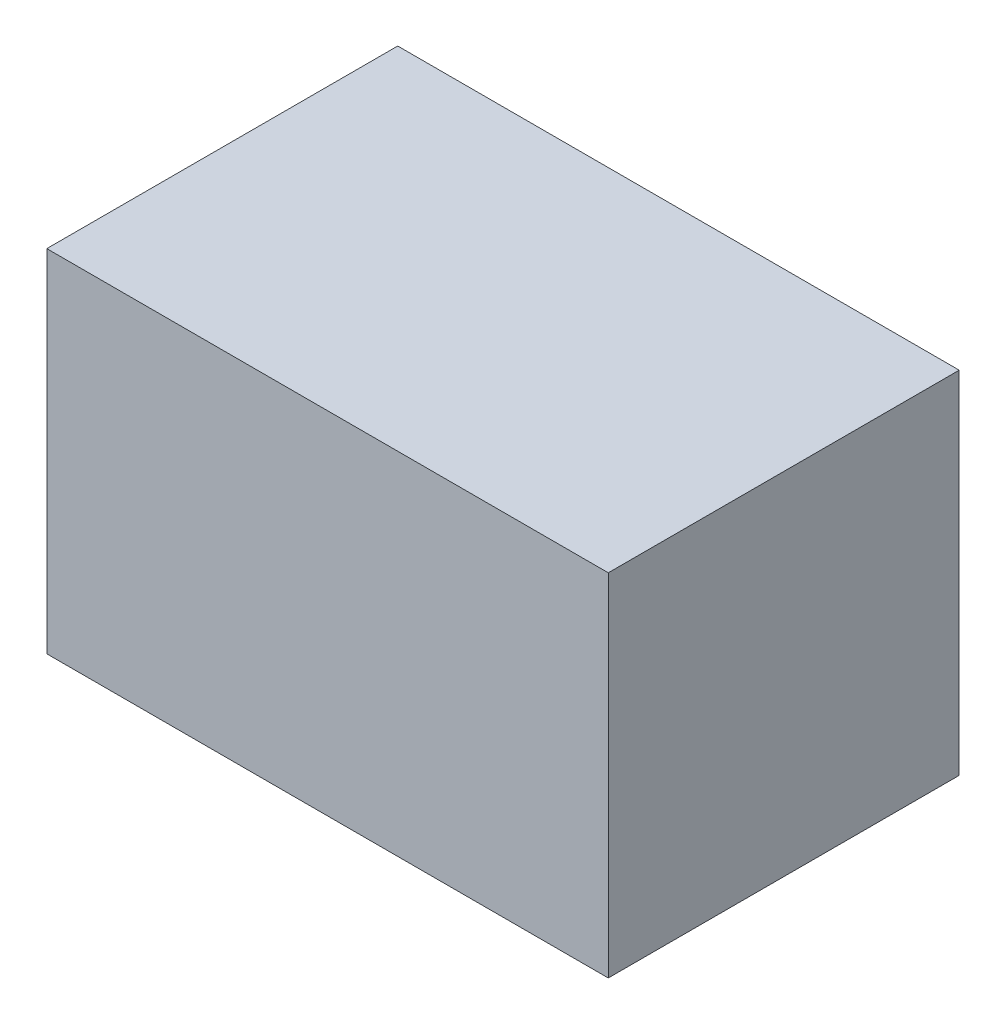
ISO-10303-21;
HEADER;
FILE_DESCRIPTION(('STEP AP214'),'2;1');
FILE_NAME('part.step','',(''),(''),'','','');
FILE_SCHEMA(('AUTOMOTIVE_DESIGN { 1 0 10303 214 1 1 1 1 }'));
ENDSEC;
DATA;
#1=APPLICATION_CONTEXT('core data for automotive mechanical design processes');
#2=APPLICATION_PROTOCOL_DEFINITION('international standard','automotive_design',2000,#1);
#3=PRODUCT_CONTEXT('',#1,'mechanical');
#4=PRODUCT('Part','Part','',(#3));
#5=PRODUCT_RELATED_PRODUCT_CATEGORY('part','',(#4));
#6=PRODUCT_DEFINITION_FORMATION('','',#4);
#7=PRODUCT_DEFINITION_CONTEXT('part definition',#1,'design');
#8=PRODUCT_DEFINITION('design','',#6,#7);
#9=PRODUCT_DEFINITION_SHAPE('','',#8);
#10=(LENGTH_UNIT() NAMED_UNIT(*) SI_UNIT(.MILLI.,.METRE.));
#11=(NAMED_UNIT(*) PLANE_ANGLE_UNIT() SI_UNIT($,.RADIAN.));
#12=(NAMED_UNIT(*) SI_UNIT($,.STERADIAN.) SOLID_ANGLE_UNIT());
#13=UNCERTAINTY_MEASURE_WITH_UNIT(LENGTH_MEASURE(1.E-05),#10,'distance_accuracy_value','');
#14=(GEOMETRIC_REPRESENTATION_CONTEXT(3) GLOBAL_UNCERTAINTY_ASSIGNED_CONTEXT((#13)) GLOBAL_UNIT_ASSIGNED_CONTEXT((#10,
#11,#12)) REPRESENTATION_CONTEXT('',''));
#15=CARTESIAN_POINT('',(0.,0.,0.));
#16=DIRECTION('',(0.,0.,1.));
#17=DIRECTION('',(1.,0.,0.));
#18=AXIS2_PLACEMENT_3D('',#15,#16,#17);
#19=CARTESIAN_POINT('',(40.,50.,25.));
#20=DIRECTION('',(-1.,0.,0.));
#21=DIRECTION('',(0.,0.,1.));
#22=AXIS2_PLACEMENT_3D('',#19,#20,#21);
#23=PLANE('',#22);
#24=DIRECTION('',(0.,0.,-1.));
#25=VECTOR('',#24,1.);
#26=CARTESIAN_POINT('',(40.,0.,25.));
#27=LINE('',#26,#25);
#28=CARTESIAN_POINT('',(40.,0.,25.));
#29=VERTEX_POINT('',#28);
#30=CARTESIAN_POINT('',(40.,0.,-25.));
#31=VERTEX_POINT('',#30);
#32=EDGE_CURVE('E209',#29,#31,#27,.T.);
#33=ORIENTED_EDGE('',*,*,#32,.T.);
#34=DIRECTION('',(0.,-1.,0.));
#35=VECTOR('',#34,1.);
#36=CARTESIAN_POINT('',(40.,50.,-25.));
#37=LINE('',#36,#35);
#38=CARTESIAN_POINT('',(40.,50.,-25.));
#39=VERTEX_POINT('',#38);
#40=EDGE_CURVE('E236',#39,#31,#37,.T.);
#41=ORIENTED_EDGE('',*,*,#40,.F.);
#42=DIRECTION('',(0.,0.,-1.));
#43=VECTOR('',#42,1.);
#44=CARTESIAN_POINT('',(40.,50.,25.));
#45=LINE('',#44,#43);
#46=CARTESIAN_POINT('',(40.,50.,25.));
#47=VERTEX_POINT('',#46);
#48=EDGE_CURVE('E210',#47,#39,#45,.T.);
#49=ORIENTED_EDGE('',*,*,#48,.F.);
#50=DIRECTION('',(0.,-1.,0.));
#51=VECTOR('',#50,1.);
#52=CARTESIAN_POINT('',(40.,50.,25.));
#53=LINE('',#52,#51);
#54=EDGE_CURVE('E220',#47,#29,#53,.T.);
#55=ORIENTED_EDGE('',*,*,#54,.T.);
#56=EDGE_LOOP('',(#33,#41,#49,#55));
#57=FACE_BOUND('',#56,.T.);
#58=ADVANCED_FACE('F35',(#57),#23,.F.);
#59=CARTESIAN_POINT('',(-40.,50.,-25.));
#60=DIRECTION('',(0.,0.,1.));
#61=DIRECTION('',(1.,0.,0.));
#62=AXIS2_PLACEMENT_3D('',#59,#60,#61);
#63=PLANE('',#62);
#64=DIRECTION('',(-1.,0.,0.));
#65=VECTOR('',#64,1.);
#66=CARTESIAN_POINT('',(-40.,0.,-25.));
#67=LINE('',#66,#65);
#68=CARTESIAN_POINT('',(-40.,0.,-25.));
#69=VERTEX_POINT('',#68);
#70=EDGE_CURVE('E223',#31,#69,#67,.T.);
#71=ORIENTED_EDGE('',*,*,#70,.T.);
#72=DIRECTION('',(0.,-1.,0.));
#73=VECTOR('',#72,1.);
#74=CARTESIAN_POINT('',(-40.,50.,-25.));
#75=LINE('',#74,#73);
#76=CARTESIAN_POINT('',(-40.,50.,-25.));
#77=VERTEX_POINT('',#76);
#78=EDGE_CURVE('E233',#77,#69,#75,.T.);
#79=ORIENTED_EDGE('',*,*,#78,.F.);
#80=DIRECTION('',(-1.,0.,0.));
#81=VECTOR('',#80,1.);
#82=CARTESIAN_POINT('',(-40.,50.,-25.));
#83=LINE('',#82,#81);
#84=EDGE_CURVE('E213',#39,#77,#83,.T.);
#85=ORIENTED_EDGE('',*,*,#84,.F.);
#86=ORIENTED_EDGE('',*,*,#40,.T.);
#87=EDGE_LOOP('',(#71,#79,#85,#86));
#88=FACE_BOUND('',#87,.T.);
#89=ADVANCED_FACE('F339',(#88),#63,.F.);
#90=CARTESIAN_POINT('',(-40.,50.,25.));
#91=DIRECTION('',(1.,0.,0.));
#92=DIRECTION('',(0.,0.,-1.));
#93=AXIS2_PLACEMENT_3D('',#90,#91,#92);
#94=PLANE('',#93);
#95=DIRECTION('',(0.,0.,1.));
#96=VECTOR('',#95,1.);
#97=CARTESIAN_POINT('',(-40.,0.,25.));
#98=LINE('',#97,#96);
#99=CARTESIAN_POINT('',(-40.,0.,25.));
#100=VERTEX_POINT('',#99);
#101=EDGE_CURVE('E225',#69,#100,#98,.T.);
#102=ORIENTED_EDGE('',*,*,#101,.T.);
#103=DIRECTION('',(0.,-1.,0.));
#104=VECTOR('',#103,1.);
#105=CARTESIAN_POINT('',(-40.,50.,25.));
#106=LINE('',#105,#104);
#107=CARTESIAN_POINT('',(-40.,50.,25.));
#108=VERTEX_POINT('',#107);
#109=EDGE_CURVE('E230',#108,#100,#106,.T.);
#110=ORIENTED_EDGE('',*,*,#109,.F.);
#111=DIRECTION('',(0.,0.,1.));
#112=VECTOR('',#111,1.);
#113=CARTESIAN_POINT('',(-40.,50.,25.));
#114=LINE('',#113,#112);
#115=EDGE_CURVE('E216',#77,#108,#114,.T.);
#116=ORIENTED_EDGE('',*,*,#115,.F.);
#117=ORIENTED_EDGE('',*,*,#78,.T.);
#118=EDGE_LOOP('',(#102,#110,#116,#117));
#119=FACE_BOUND('',#118,.T.);
#120=ADVANCED_FACE('F335',(#119),#94,.F.);
#121=CARTESIAN_POINT('',(-40.,50.,25.));
#122=DIRECTION('',(0.,0.,-1.));
#123=DIRECTION('',(-1.,0.,0.));
#124=AXIS2_PLACEMENT_3D('',#121,#122,#123);
#125=PLANE('',#124);
#126=DIRECTION('',(1.,0.,0.));
#127=VECTOR('',#126,1.);
#128=CARTESIAN_POINT('',(-40.,0.,25.));
#129=LINE('',#128,#127);
#130=EDGE_CURVE('E214',#100,#29,#129,.T.);
#131=ORIENTED_EDGE('',*,*,#130,.T.);
#132=ORIENTED_EDGE('',*,*,#54,.F.);
#133=DIRECTION('',(1.,0.,0.));
#134=VECTOR('',#133,1.);
#135=CARTESIAN_POINT('',(-40.,50.,25.));
#136=LINE('',#135,#134);
#137=EDGE_CURVE('E218',#108,#47,#136,.T.);
#138=ORIENTED_EDGE('',*,*,#137,.F.);
#139=ORIENTED_EDGE('',*,*,#109,.T.);
#140=EDGE_LOOP('',(#131,#132,#138,#139));
#141=FACE_BOUND('',#140,.T.);
#142=ADVANCED_FACE('F329',(#141),#125,.F.);
#143=CARTESIAN_POINT('',(40.,50.,-25.));
#144=DIRECTION('',(0.,-1.,0.));
#145=DIRECTION('',(0.,0.,-1.));
#146=AXIS2_PLACEMENT_3D('',#143,#144,#145);
#147=PLANE('',#146);
#148=ORIENTED_EDGE('',*,*,#48,.T.);
#149=ORIENTED_EDGE('',*,*,#84,.T.);
#150=ORIENTED_EDGE('',*,*,#115,.T.);
#151=ORIENTED_EDGE('',*,*,#137,.T.);
#152=EDGE_LOOP('',(#148,#149,#150,#151));
#153=FACE_BOUND('',#152,.T.);
#154=ADVANCED_FACE('F325',(#153),#147,.F.);
#155=CARTESIAN_POINT('',(40.,0.,-25.));
#156=DIRECTION('',(0.,-1.,0.));
#157=DIRECTION('',(0.,0.,-1.));
#158=AXIS2_PLACEMENT_3D('',#155,#156,#157);
#159=PLANE('',#158);
#160=ORIENTED_EDGE('',*,*,#32,.F.);
#161=ORIENTED_EDGE('',*,*,#130,.F.);
#162=ORIENTED_EDGE('',*,*,#101,.F.);
#163=ORIENTED_EDGE('',*,*,#70,.F.);
#164=EDGE_LOOP('',(#160,#161,#162,#163));
#165=FACE_BOUND('',#164,.T.);
#166=ADVANCED_FACE('F328',(#165),#159,.T.);
#167=CLOSED_SHELL('',(#58,#89,#120,#142,#154,#166));
#168=CARTESIAN_POINT('',(40.,5.,-25.));
#169=DIRECTION('',(0.,-1.,0.));
#170=DIRECTION('',(0.,0.,-1.));
#171=AXIS2_PLACEMENT_3D('',#168,#169,#170);
#172=PLANE('',#171);
#173=CARTESIAN_POINT('',(-20.,5.,-11.));
#174=DIRECTION('',(0.,1.,0.));
#175=DIRECTION('',(0.,0.,1.));
#176=AXIS2_PLACEMENT_3D('',#173,#174,#175);
#177=CIRCLE('',#176,2.);
#178=CARTESIAN_POINT('',(-20.,5.,-13.));
#179=VERTEX_POINT('',#178);
#180=CARTESIAN_POINT('',(-20.,5.,-8.99999999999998));
#181=VERTEX_POINT('',#180);
#182=EDGE_CURVE('E171',#179,#181,#177,.T.);
#183=ORIENTED_EDGE('',*,*,#182,.F.);
#184=DIRECTION('',(-1.,0.,0.));
#185=VECTOR('',#184,1.);
#186=CARTESIAN_POINT('',(-20.,5.,-13.));
#187=LINE('',#186,#185);
#188=CARTESIAN_POINT('',(20.,5.,-13.));
#189=VERTEX_POINT('',#188);
#190=EDGE_CURVE('E184',#189,#179,#187,.T.);
#191=ORIENTED_EDGE('',*,*,#190,.F.);
#192=CARTESIAN_POINT('',(20.,5.,-11.));
#193=DIRECTION('',(0.,1.,0.));
#194=DIRECTION('',(0.,0.,1.));
#195=AXIS2_PLACEMENT_3D('',#192,#193,#194);
#196=CIRCLE('',#195,2.);
#197=CARTESIAN_POINT('',(20.,5.,-8.99999999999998));
#198=VERTEX_POINT('',#197);
#199=EDGE_CURVE('E193',#198,#189,#196,.T.);
#200=ORIENTED_EDGE('',*,*,#199,.F.);
#201=DIRECTION('',(1.,0.,0.));
#202=VECTOR('',#201,1.);
#203=CARTESIAN_POINT('',(-20.,5.,-8.99999999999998));
#204=LINE('',#203,#202);
#205=EDGE_CURVE('E174',#181,#198,#204,.T.);
#206=ORIENTED_EDGE('',*,*,#205,.F.);
#207=EDGE_LOOP('',(#183,#191,#200,#206));
#208=FACE_BOUND('',#207,.T.);
#209=DIRECTION('',(0.,0.,-1.));
#210=VECTOR('',#209,1.);
#211=CARTESIAN_POINT('',(35.,5.,-25.));
#212=LINE('',#211,#210);
#213=CARTESIAN_POINT('',(35.,5.,20.));
#214=VERTEX_POINT('',#213);
#215=CARTESIAN_POINT('',(35.,5.,-20.));
#216=VERTEX_POINT('',#215);
#217=EDGE_CURVE('E39',#214,#216,#212,.T.);
#218=ORIENTED_EDGE('',*,*,#217,.T.);
#219=DIRECTION('',(-1.,0.,0.));
#220=VECTOR('',#219,1.);
#221=CARTESIAN_POINT('',(40.,5.,-20.));
#222=LINE('',#221,#220);
#223=CARTESIAN_POINT('',(-35.,5.,-20.));
#224=VERTEX_POINT('',#223);
#225=EDGE_CURVE('E258',#216,#224,#222,.T.);
#226=ORIENTED_EDGE('',*,*,#225,.T.);
#227=DIRECTION('',(0.,0.,1.));
#228=VECTOR('',#227,1.);
#229=CARTESIAN_POINT('',(-35.,5.,-25.));
#230=LINE('',#229,#228);
#231=CARTESIAN_POINT('',(-35.,5.,20.));
#232=VERTEX_POINT('',#231);
#233=EDGE_CURVE('E253',#224,#232,#230,.T.);
#234=ORIENTED_EDGE('',*,*,#233,.T.);
#235=DIRECTION('',(1.,0.,0.));
#236=VECTOR('',#235,1.);
#237=CARTESIAN_POINT('',(40.,5.,20.));
#238=LINE('',#237,#236);
#239=EDGE_CURVE('E248',#232,#214,#238,.T.);
#240=ORIENTED_EDGE('',*,*,#239,.T.);
#241=EDGE_LOOP('',(#218,#226,#234,#240));
#242=FACE_BOUND('',#241,.T.);
#243=CARTESIAN_POINT('',(-20.,5.,11.));
#244=DIRECTION('',(0.,1.,0.));
#245=DIRECTION('',(0.,0.,1.));
#246=AXIS2_PLACEMENT_3D('',#243,#244,#245);
#247=CIRCLE('',#246,2.);
#248=CARTESIAN_POINT('',(-20.,5.,8.99999999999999));
#249=VERTEX_POINT('',#248);
#250=CARTESIAN_POINT('',(-20.,5.,13.));
#251=VERTEX_POINT('',#250);
#252=EDGE_CURVE('E170',#249,#251,#247,.T.);
#253=ORIENTED_EDGE('',*,*,#252,.F.);
#254=DIRECTION('',(-1.,0.,0.));
#255=VECTOR('',#254,1.);
#256=CARTESIAN_POINT('',(-20.,5.,8.99999999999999));
#257=LINE('',#256,#255);
#258=CARTESIAN_POINT('',(20.,5.,8.99999999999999));
#259=VERTEX_POINT('',#258);
#260=EDGE_CURVE('E167',#259,#249,#257,.T.);
#261=ORIENTED_EDGE('',*,*,#260,.F.);
#262=CARTESIAN_POINT('',(20.,5.,11.));
#263=DIRECTION('',(0.,1.,0.));
#264=DIRECTION('',(0.,0.,1.));
#265=AXIS2_PLACEMENT_3D('',#262,#263,#264);
#266=CIRCLE('',#265,2.);
#267=CARTESIAN_POINT('',(20.,5.,13.));
#268=VERTEX_POINT('',#267);
#269=EDGE_CURVE('E58',#268,#259,#266,.T.);
#270=ORIENTED_EDGE('',*,*,#269,.F.);
#271=DIRECTION('',(1.,0.,0.));
#272=VECTOR('',#271,1.);
#273=CARTESIAN_POINT('',(-20.,5.,13.));
#274=LINE('',#273,#272);
#275=EDGE_CURVE('E53',#251,#268,#274,.T.);
#276=ORIENTED_EDGE('',*,*,#275,.F.);
#277=EDGE_LOOP('',(#253,#261,#270,#276));
#278=FACE_BOUND('',#277,.T.);
#279=ADVANCED_FACE('F37',(#208,#242,#278),#172,.F.);
#280=CARTESIAN_POINT('',(35.,50.,25.));
#281=DIRECTION('',(-1.,0.,0.));
#282=DIRECTION('',(0.,0.,1.));
#283=AXIS2_PLACEMENT_3D('',#280,#281,#282);
#284=PLANE('',#283);
#285=ORIENTED_EDGE('',*,*,#217,.F.);
#286=DIRECTION('',(0.,-1.,0.));
#287=VECTOR('',#286,1.);
#288=CARTESIAN_POINT('',(35.,50.,20.));
#289=LINE('',#288,#287);
#290=CARTESIAN_POINT('',(35.,45.,20.));
#291=VERTEX_POINT('',#290);
#292=EDGE_CURVE('E259',#291,#214,#289,.T.);
#293=ORIENTED_EDGE('',*,*,#292,.F.);
#294=DIRECTION('',(0.,0.,-1.));
#295=VECTOR('',#294,1.);
#296=CARTESIAN_POINT('',(35.,45.,-25.));
#297=LINE('',#296,#295);
#298=CARTESIAN_POINT('',(35.,45.,-20.));
#299=VERTEX_POINT('',#298);
#300=EDGE_CURVE('E242',#291,#299,#297,.T.);
#301=ORIENTED_EDGE('',*,*,#300,.T.);
#302=DIRECTION('',(0.,-1.,0.));
#303=VECTOR('',#302,1.);
#304=CARTESIAN_POINT('',(35.,50.,-20.));
#305=LINE('',#304,#303);
#306=EDGE_CURVE('E255',#299,#216,#305,.T.);
#307=ORIENTED_EDGE('',*,*,#306,.T.);
#308=EDGE_LOOP('',(#285,#293,#301,#307));
#309=FACE_BOUND('',#308,.T.);
#310=ADVANCED_FACE('F268',(#309),#284,.T.);
#311=CARTESIAN_POINT('',(-40.,50.,-20.));
#312=DIRECTION('',(0.,0.,1.));
#313=DIRECTION('',(1.,0.,0.));
#314=AXIS2_PLACEMENT_3D('',#311,#312,#313);
#315=PLANE('',#314);
#316=ORIENTED_EDGE('',*,*,#225,.F.);
#317=ORIENTED_EDGE('',*,*,#306,.F.);
#318=DIRECTION('',(-1.,0.,0.));
#319=VECTOR('',#318,1.);
#320=CARTESIAN_POINT('',(40.,45.,-20.));
#321=LINE('',#320,#319);
#322=CARTESIAN_POINT('',(-35.,45.,-20.));
#323=VERTEX_POINT('',#322);
#324=EDGE_CURVE('E240',#299,#323,#321,.T.);
#325=ORIENTED_EDGE('',*,*,#324,.T.);
#326=DIRECTION('',(0.,-1.,0.));
#327=VECTOR('',#326,1.);
#328=CARTESIAN_POINT('',(-35.,50.,-20.));
#329=LINE('',#328,#327);
#330=EDGE_CURVE('E250',#323,#224,#329,.T.);
#331=ORIENTED_EDGE('',*,*,#330,.T.);
#332=EDGE_LOOP('',(#316,#317,#325,#331));
#333=FACE_BOUND('',#332,.T.);
#334=ADVANCED_FACE('F272',(#333),#315,.T.);
#335=CARTESIAN_POINT('',(-35.,50.,25.));
#336=DIRECTION('',(1.,0.,0.));
#337=DIRECTION('',(0.,0.,-1.));
#338=AXIS2_PLACEMENT_3D('',#335,#336,#337);
#339=PLANE('',#338);
#340=ORIENTED_EDGE('',*,*,#233,.F.);
#341=ORIENTED_EDGE('',*,*,#330,.F.);
#342=DIRECTION('',(0.,0.,1.));
#343=VECTOR('',#342,1.);
#344=CARTESIAN_POINT('',(-35.,45.,-25.));
#345=LINE('',#344,#343);
#346=CARTESIAN_POINT('',(-35.,45.,20.));
#347=VERTEX_POINT('',#346);
#348=EDGE_CURVE('E45',#323,#347,#345,.T.);
#349=ORIENTED_EDGE('',*,*,#348,.T.);
#350=DIRECTION('',(0.,-1.,0.));
#351=VECTOR('',#350,1.);
#352=CARTESIAN_POINT('',(-35.,50.,20.));
#353=LINE('',#352,#351);
#354=EDGE_CURVE('E245',#347,#232,#353,.T.);
#355=ORIENTED_EDGE('',*,*,#354,.T.);
#356=EDGE_LOOP('',(#340,#341,#349,#355));
#357=FACE_BOUND('',#356,.T.);
#358=ADVANCED_FACE('F277',(#357),#339,.T.);
#359=CARTESIAN_POINT('',(-40.,50.,20.));
#360=DIRECTION('',(0.,0.,-1.));
#361=DIRECTION('',(-1.,0.,0.));
#362=AXIS2_PLACEMENT_3D('',#359,#360,#361);
#363=PLANE('',#362);
#364=ORIENTED_EDGE('',*,*,#239,.F.);
#365=ORIENTED_EDGE('',*,*,#354,.F.);
#366=DIRECTION('',(1.,0.,0.));
#367=VECTOR('',#366,1.);
#368=CARTESIAN_POINT('',(40.,45.,20.));
#369=LINE('',#368,#367);
#370=EDGE_CURVE('E11',#347,#291,#369,.T.);
#371=ORIENTED_EDGE('',*,*,#370,.T.);
#372=ORIENTED_EDGE('',*,*,#292,.T.);
#373=EDGE_LOOP('',(#364,#365,#371,#372));
#374=FACE_BOUND('',#373,.T.);
#375=ADVANCED_FACE('F280',(#374),#363,.T.);
#376=CARTESIAN_POINT('',(40.,45.,-25.));
#377=DIRECTION('',(0.,-1.,0.));
#378=DIRECTION('',(0.,0.,-1.));
#379=AXIS2_PLACEMENT_3D('',#376,#377,#378);
#380=PLANE('',#379);
#381=ORIENTED_EDGE('',*,*,#300,.F.);
#382=ORIENTED_EDGE('',*,*,#370,.F.);
#383=ORIENTED_EDGE('',*,*,#348,.F.);
#384=ORIENTED_EDGE('',*,*,#324,.F.);
#385=EDGE_LOOP('',(#381,#382,#383,#384));
#386=FACE_BOUND('',#385,.T.);
#387=ADVANCED_FACE('F282',(#386),#380,.T.);
#388=CARTESIAN_POINT('',(-20.,10.,-11.));
#389=DIRECTION('',(0.,-1.,0.));
#390=DIRECTION('',(0.,0.,-1.));
#391=AXIS2_PLACEMENT_3D('',#388,#389,#390);
#392=CYLINDRICAL_SURFACE('',#391,2.);
#393=ORIENTED_EDGE('',*,*,#182,.T.);
#394=DIRECTION('',(0.,-1.,0.));
#395=VECTOR('',#394,1.);
#396=CARTESIAN_POINT('',(-20.,10.,-8.99999999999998));
#397=LINE('',#396,#395);
#398=CARTESIAN_POINT('',(-20.,10.,-8.99999999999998));
#399=VERTEX_POINT('',#398);
#400=EDGE_CURVE('E206',#399,#181,#397,.T.);
#401=ORIENTED_EDGE('',*,*,#400,.F.);
#402=CARTESIAN_POINT('',(-20.,10.,-11.));
#403=DIRECTION('',(0.,1.,0.));
#404=DIRECTION('',(0.,0.,1.));
#405=AXIS2_PLACEMENT_3D('',#402,#403,#404);
#406=CIRCLE('',#405,2.);
#407=CARTESIAN_POINT('',(-20.,10.,-13.));
#408=VERTEX_POINT('',#407);
#409=EDGE_CURVE('E180',#408,#399,#406,.T.);
#410=ORIENTED_EDGE('',*,*,#409,.F.);
#411=DIRECTION('',(0.,-1.,0.));
#412=VECTOR('',#411,1.);
#413=CARTESIAN_POINT('',(-20.,10.,-13.));
#414=LINE('',#413,#412);
#415=EDGE_CURVE('E189',#408,#179,#414,.T.);
#416=ORIENTED_EDGE('',*,*,#415,.T.);
#417=EDGE_LOOP('',(#393,#401,#410,#416));
#418=FACE_BOUND('',#417,.T.);
#419=ADVANCED_FACE('F289',(#418),#392,.T.);
#420=CARTESIAN_POINT('',(-20.,10.,-8.99999999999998));
#421=DIRECTION('',(0.,0.,-1.));
#422=DIRECTION('',(-1.,0.,0.));
#423=AXIS2_PLACEMENT_3D('',#420,#421,#422);
#424=PLANE('',#423);
#425=ORIENTED_EDGE('',*,*,#205,.T.);
#426=DIRECTION('',(0.,-1.,0.));
#427=VECTOR('',#426,1.);
#428=CARTESIAN_POINT('',(20.,10.,-8.99999999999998));
#429=LINE('',#428,#427);
#430=CARTESIAN_POINT('',(20.,10.,-8.99999999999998));
#431=VERTEX_POINT('',#430);
#432=EDGE_CURVE('E203',#431,#198,#429,.T.);
#433=ORIENTED_EDGE('',*,*,#432,.F.);
#434=DIRECTION('',(1.,0.,0.));
#435=VECTOR('',#434,1.);
#436=CARTESIAN_POINT('',(-20.,10.,-8.99999999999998));
#437=LINE('',#436,#435);
#438=EDGE_CURVE('E183',#399,#431,#437,.T.);
#439=ORIENTED_EDGE('',*,*,#438,.F.);
#440=ORIENTED_EDGE('',*,*,#400,.T.);
#441=EDGE_LOOP('',(#425,#433,#439,#440));
#442=FACE_BOUND('',#441,.T.);
#443=ADVANCED_FACE('F314',(#442),#424,.F.);
#444=CARTESIAN_POINT('',(20.,10.,-11.));
#445=DIRECTION('',(0.,-1.,0.));
#446=DIRECTION('',(0.,0.,-1.));
#447=AXIS2_PLACEMENT_3D('',#444,#445,#446);
#448=CYLINDRICAL_SURFACE('',#447,2.);
#449=ORIENTED_EDGE('',*,*,#199,.T.);
#450=DIRECTION('',(0.,-1.,0.));
#451=VECTOR('',#450,1.);
#452=CARTESIAN_POINT('',(20.,10.,-13.));
#453=LINE('',#452,#451);
#454=CARTESIAN_POINT('',(20.,10.,-13.));
#455=VERTEX_POINT('',#454);
#456=EDGE_CURVE('E200',#455,#189,#453,.T.);
#457=ORIENTED_EDGE('',*,*,#456,.F.);
#458=CARTESIAN_POINT('',(20.,10.,-11.));
#459=DIRECTION('',(0.,1.,0.));
#460=DIRECTION('',(0.,0.,1.));
#461=AXIS2_PLACEMENT_3D('',#458,#459,#460);
#462=CIRCLE('',#461,2.);
#463=EDGE_CURVE('E186',#431,#455,#462,.T.);
#464=ORIENTED_EDGE('',*,*,#463,.F.);
#465=ORIENTED_EDGE('',*,*,#432,.T.);
#466=EDGE_LOOP('',(#449,#457,#464,#465));
#467=FACE_BOUND('',#466,.T.);
#468=ADVANCED_FACE('F312',(#467),#448,.T.);
#469=CARTESIAN_POINT('',(-20.,10.,-13.));
#470=DIRECTION('',(0.,0.,1.));
#471=DIRECTION('',(1.,0.,0.));
#472=AXIS2_PLACEMENT_3D('',#469,#470,#471);
#473=PLANE('',#472);
#474=ORIENTED_EDGE('',*,*,#190,.T.);
#475=ORIENTED_EDGE('',*,*,#415,.F.);
#476=DIRECTION('',(-1.,0.,0.));
#477=VECTOR('',#476,1.);
#478=CARTESIAN_POINT('',(-20.,10.,-13.));
#479=LINE('',#478,#477);
#480=EDGE_CURVE('E188',#455,#408,#479,.T.);
#481=ORIENTED_EDGE('',*,*,#480,.F.);
#482=ORIENTED_EDGE('',*,*,#456,.T.);
#483=EDGE_LOOP('',(#474,#475,#481,#482));
#484=FACE_BOUND('',#483,.T.);
#485=ADVANCED_FACE('F303',(#484),#473,.F.);
#486=CARTESIAN_POINT('',(-20.,10.,-11.));
#487=DIRECTION('',(0.,1.,0.));
#488=DIRECTION('',(0.,0.,1.));
#489=AXIS2_PLACEMENT_3D('',#486,#487,#488);
#490=PLANE('',#489);
#491=ORIENTED_EDGE('',*,*,#409,.T.);
#492=ORIENTED_EDGE('',*,*,#438,.T.);
#493=ORIENTED_EDGE('',*,*,#463,.T.);
#494=ORIENTED_EDGE('',*,*,#480,.T.);
#495=EDGE_LOOP('',(#491,#492,#493,#494));
#496=FACE_BOUND('',#495,.T.);
#497=ADVANCED_FACE('F308',(#496),#490,.T.);
#498=CARTESIAN_POINT('',(-20.,10.,11.));
#499=DIRECTION('',(0.,-1.,0.));
#500=DIRECTION('',(0.,0.,-1.));
#501=AXIS2_PLACEMENT_3D('',#498,#499,#500);
#502=CYLINDRICAL_SURFACE('',#501,2.);
#503=ORIENTED_EDGE('',*,*,#252,.T.);
#504=DIRECTION('',(0.,-1.,0.));
#505=VECTOR('',#504,1.);
#506=CARTESIAN_POINT('',(-20.,10.,13.));
#507=LINE('',#506,#505);
#508=CARTESIAN_POINT('',(-20.,10.,13.));
#509=VERTEX_POINT('',#508);
#510=EDGE_CURVE('E151',#509,#251,#507,.T.);
#511=ORIENTED_EDGE('',*,*,#510,.F.);
#512=CARTESIAN_POINT('',(-20.,10.,11.));
#513=DIRECTION('',(0.,1.,0.));
#514=DIRECTION('',(0.,0.,1.));
#515=AXIS2_PLACEMENT_3D('',#512,#513,#514);
#516=CIRCLE('',#515,2.);
#517=CARTESIAN_POINT('',(-20.,10.,8.99999999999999));
#518=VERTEX_POINT('',#517);
#519=EDGE_CURVE('E158',#518,#509,#516,.T.);
#520=ORIENTED_EDGE('',*,*,#519,.F.);
#521=DIRECTION('',(0.,-1.,0.));
#522=VECTOR('',#521,1.);
#523=CARTESIAN_POINT('',(-20.,10.,8.99999999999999));
#524=LINE('',#523,#522);
#525=EDGE_CURVE('E503',#518,#249,#524,.T.);
#526=ORIENTED_EDGE('',*,*,#525,.T.);
#527=EDGE_LOOP('',(#503,#511,#520,#526));
#528=FACE_BOUND('',#527,.T.);
#529=ADVANCED_FACE('F169',(#528),#502,.T.);
#530=CARTESIAN_POINT('',(-20.,10.,13.));
#531=DIRECTION('',(0.,0.,-1.));
#532=DIRECTION('',(-1.,0.,0.));
#533=AXIS2_PLACEMENT_3D('',#530,#531,#532);
#534=PLANE('',#533);
#535=ORIENTED_EDGE('',*,*,#275,.T.);
#536=DIRECTION('',(0.,-1.,0.));
#537=VECTOR('',#536,1.);
#538=CARTESIAN_POINT('',(20.,10.,13.));
#539=LINE('',#538,#537);
#540=CARTESIAN_POINT('',(20.,10.,13.));
#541=VERTEX_POINT('',#540);
#542=EDGE_CURVE('E154',#541,#268,#539,.T.);
#543=ORIENTED_EDGE('',*,*,#542,.F.);
#544=DIRECTION('',(1.,0.,0.));
#545=VECTOR('',#544,1.);
#546=CARTESIAN_POINT('',(-20.,10.,13.));
#547=LINE('',#546,#545);
#548=EDGE_CURVE('E147',#509,#541,#547,.T.);
#549=ORIENTED_EDGE('',*,*,#548,.F.);
#550=ORIENTED_EDGE('',*,*,#510,.T.);
#551=EDGE_LOOP('',(#535,#543,#549,#550));
#552=FACE_BOUND('',#551,.T.);
#553=ADVANCED_FACE('F149',(#552),#534,.F.);
#554=CARTESIAN_POINT('',(20.,10.,11.));
#555=DIRECTION('',(0.,-1.,0.));
#556=DIRECTION('',(0.,0.,-1.));
#557=AXIS2_PLACEMENT_3D('',#554,#555,#556);
#558=CYLINDRICAL_SURFACE('',#557,2.);
#559=ORIENTED_EDGE('',*,*,#269,.T.);
#560=DIRECTION('',(0.,-1.,0.));
#561=VECTOR('',#560,1.);
#562=CARTESIAN_POINT('',(20.,10.,8.99999999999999));
#563=LINE('',#562,#561);
#564=CARTESIAN_POINT('',(20.,10.,8.99999999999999));
#565=VERTEX_POINT('',#564);
#566=EDGE_CURVE('E176',#565,#259,#563,.T.);
#567=ORIENTED_EDGE('',*,*,#566,.F.);
#568=CARTESIAN_POINT('',(20.,10.,11.));
#569=DIRECTION('',(0.,1.,0.));
#570=DIRECTION('',(0.,0.,1.));
#571=AXIS2_PLACEMENT_3D('',#568,#569,#570);
#572=CIRCLE('',#571,2.);
#573=EDGE_CURVE('E157',#541,#565,#572,.T.);
#574=ORIENTED_EDGE('',*,*,#573,.F.);
#575=ORIENTED_EDGE('',*,*,#542,.T.);
#576=EDGE_LOOP('',(#559,#567,#574,#575));
#577=FACE_BOUND('',#576,.T.);
#578=ADVANCED_FACE('F467',(#577),#558,.T.);
#579=CARTESIAN_POINT('',(-20.,10.,8.99999999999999));
#580=DIRECTION('',(0.,0.,1.));
#581=DIRECTION('',(1.,0.,0.));
#582=AXIS2_PLACEMENT_3D('',#579,#580,#581);
#583=PLANE('',#582);
#584=ORIENTED_EDGE('',*,*,#260,.T.);
#585=ORIENTED_EDGE('',*,*,#525,.F.);
#586=DIRECTION('',(-1.,0.,0.));
#587=VECTOR('',#586,1.);
#588=CARTESIAN_POINT('',(-20.,10.,8.99999999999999));
#589=LINE('',#588,#587);
#590=EDGE_CURVE('E163',#565,#518,#589,.T.);
#591=ORIENTED_EDGE('',*,*,#590,.F.);
#592=ORIENTED_EDGE('',*,*,#566,.T.);
#593=EDGE_LOOP('',(#584,#585,#591,#592));
#594=FACE_BOUND('',#593,.T.);
#595=ADVANCED_FACE('F475',(#594),#583,.F.);
#596=CARTESIAN_POINT('',(-20.,10.,11.));
#597=DIRECTION('',(0.,1.,0.));
#598=DIRECTION('',(0.,0.,1.));
#599=AXIS2_PLACEMENT_3D('',#596,#597,#598);
#600=PLANE('',#599);
#601=ORIENTED_EDGE('',*,*,#519,.T.);
#602=ORIENTED_EDGE('',*,*,#548,.T.);
#603=ORIENTED_EDGE('',*,*,#573,.T.);
#604=ORIENTED_EDGE('',*,*,#590,.T.);
#605=EDGE_LOOP('',(#601,#602,#603,#604));
#606=FACE_BOUND('',#605,.T.);
#607=ADVANCED_FACE('F161',(#606),#600,.T.);
#608=CLOSED_SHELL('',(#279,#310,#334,#358,#375,#387,#419,#443,#468,#485,#497,#529,#553,#578,
#595,#607));
#609=ORIENTED_CLOSED_SHELL('',*,#608,.T.);
#610=BREP_WITH_VOIDS('B2',#167,(#609));
#611=ADVANCED_BREP_SHAPE_REPRESENTATION('',(#18,#610),#14);
#612=SHAPE_DEFINITION_REPRESENTATION(#9,#611);
ENDSEC;
END-ISO-10303-21;
